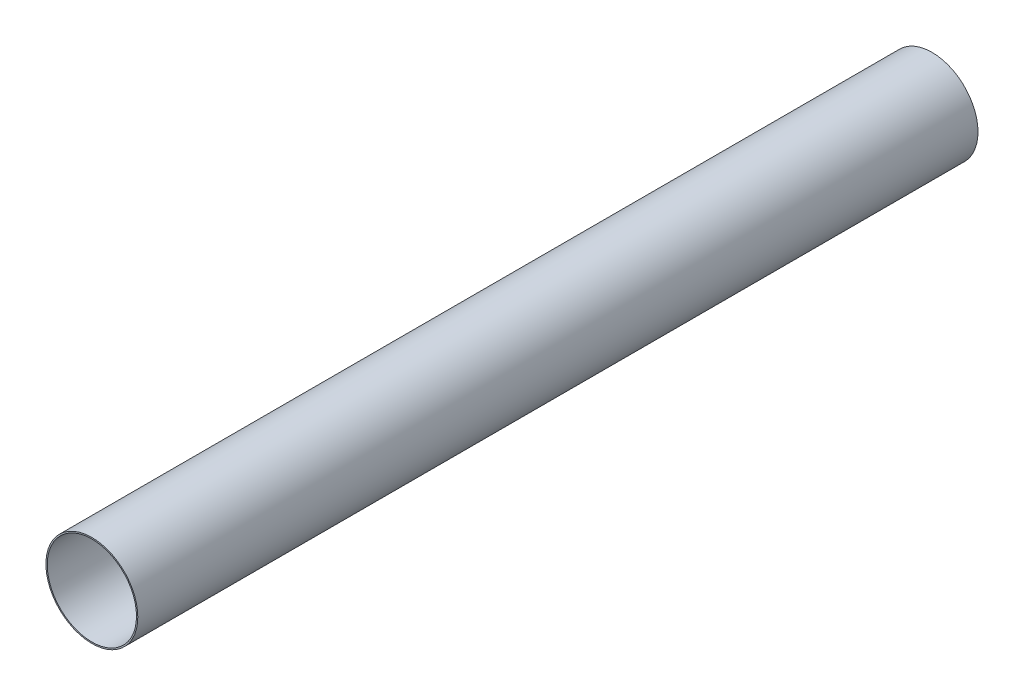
ISO-10303-21;
HEADER;
FILE_DESCRIPTION(('STEP AP214'),'2;1');
FILE_NAME('part.step','',(''),(''),'','','');
FILE_SCHEMA(('AUTOMOTIVE_DESIGN { 1 0 10303 214 1 1 1 1 }'));
ENDSEC;
DATA;
#1=APPLICATION_CONTEXT('core data for automotive mechanical design processes');
#2=APPLICATION_PROTOCOL_DEFINITION('international standard','automotive_design',2000,#1);
#3=PRODUCT_CONTEXT('',#1,'mechanical');
#4=PRODUCT('Part','Part','',(#3));
#5=PRODUCT_RELATED_PRODUCT_CATEGORY('part','',(#4));
#6=PRODUCT_DEFINITION_FORMATION('','',#4);
#7=PRODUCT_DEFINITION_CONTEXT('part definition',#1,'design');
#8=PRODUCT_DEFINITION('design','',#6,#7);
#9=PRODUCT_DEFINITION_SHAPE('','',#8);
#10=(LENGTH_UNIT() NAMED_UNIT(*) SI_UNIT(.MILLI.,.METRE.));
#11=(NAMED_UNIT(*) PLANE_ANGLE_UNIT() SI_UNIT($,.RADIAN.));
#12=(NAMED_UNIT(*) SI_UNIT($,.STERADIAN.) SOLID_ANGLE_UNIT());
#13=UNCERTAINTY_MEASURE_WITH_UNIT(LENGTH_MEASURE(1.E-05),#10,'distance_accuracy_value','');
#14=(GEOMETRIC_REPRESENTATION_CONTEXT(3) GLOBAL_UNCERTAINTY_ASSIGNED_CONTEXT((#13)) GLOBAL_UNIT_ASSIGNED_CONTEXT((#10,
#11,#12)) REPRESENTATION_CONTEXT('',''));
#15=CARTESIAN_POINT('',(0.,0.,0.));
#16=DIRECTION('',(0.,0.,1.));
#17=DIRECTION('',(1.,0.,0.));
#18=AXIS2_PLACEMENT_3D('',#15,#16,#17);
#19=CARTESIAN_POINT('',(0.,0.,508.));
#20=DIRECTION('',(0.,0.,1.));
#21=DIRECTION('',(1.,0.,0.));
#22=AXIS2_PLACEMENT_3D('',#19,#20,#21);
#23=PLANE('',#22);
#24=CARTESIAN_POINT('',(0.,0.,508.));
#25=DIRECTION('',(0.,0.,1.));
#26=DIRECTION('',(1.,0.,0.));
#27=AXIS2_PLACEMENT_3D('',#24,#25,#26);
#28=CIRCLE('',#27,27.78125);
#29=CARTESIAN_POINT('',(27.78125,0.,508.));
#30=VERTEX_POINT('',#29);
#31=EDGE_CURVE('E10',#30,#30,#28,.T.);
#32=ORIENTED_EDGE('',*,*,#31,.T.);
#33=EDGE_LOOP('',(#32));
#34=FACE_BOUND('',#33,.T.);
#35=CARTESIAN_POINT('',(0.,0.,508.));
#36=DIRECTION('',(0.,0.,1.));
#37=DIRECTION('',(1.,0.,0.));
#38=AXIS2_PLACEMENT_3D('',#35,#36,#37);
#39=CIRCLE('',#38,26.9875);
#40=CARTESIAN_POINT('',(26.9875,0.,508.));
#41=VERTEX_POINT('',#40);
#42=EDGE_CURVE('E40',#41,#41,#39,.T.);
#43=ORIENTED_EDGE('',*,*,#42,.F.);
#44=EDGE_LOOP('',(#43));
#45=FACE_BOUND('',#44,.T.);
#46=ADVANCED_FACE('F29',(#34,#45),#23,.T.);
#47=CARTESIAN_POINT('',(0.,0.,0.));
#48=DIRECTION('',(0.,0.,1.));
#49=DIRECTION('',(1.,0.,0.));
#50=AXIS2_PLACEMENT_3D('',#47,#48,#49);
#51=PLANE('',#50);
#52=CARTESIAN_POINT('',(0.,0.,0.));
#53=DIRECTION('',(0.,0.,1.));
#54=DIRECTION('',(1.,0.,0.));
#55=AXIS2_PLACEMENT_3D('',#52,#53,#54);
#56=CIRCLE('',#55,27.78125);
#57=CARTESIAN_POINT('',(27.78125,0.,0.));
#58=VERTEX_POINT('',#57);
#59=EDGE_CURVE('E36',#58,#58,#56,.T.);
#60=ORIENTED_EDGE('',*,*,#59,.F.);
#61=EDGE_LOOP('',(#60));
#62=FACE_BOUND('',#61,.T.);
#63=CARTESIAN_POINT('',(0.,0.,0.));
#64=DIRECTION('',(0.,0.,1.));
#65=DIRECTION('',(1.,0.,0.));
#66=AXIS2_PLACEMENT_3D('',#63,#64,#65);
#67=CIRCLE('',#66,26.9875);
#68=CARTESIAN_POINT('',(26.9875,0.,0.));
#69=VERTEX_POINT('',#68);
#70=EDGE_CURVE('E44',#69,#69,#67,.T.);
#71=ORIENTED_EDGE('',*,*,#70,.T.);
#72=EDGE_LOOP('',(#71));
#73=FACE_BOUND('',#72,.T.);
#74=ADVANCED_FACE('F50',(#62,#73),#51,.F.);
#75=CARTESIAN_POINT('',(0.,0.,508.));
#76=DIRECTION('',(0.,0.,-1.));
#77=DIRECTION('',(-1.,0.,0.));
#78=AXIS2_PLACEMENT_3D('',#75,#76,#77);
#79=CYLINDRICAL_SURFACE('',#78,27.78125);
#80=ORIENTED_EDGE('',*,*,#31,.F.);
#81=EDGE_LOOP('',(#80));
#82=FACE_BOUND('',#81,.T.);
#83=ORIENTED_EDGE('',*,*,#59,.T.);
#84=EDGE_LOOP('',(#83));
#85=FACE_BOUND('',#84,.T.);
#86=ADVANCED_FACE('F31',(#82,#85),#79,.T.);
#87=CARTESIAN_POINT('',(0.,0.,508.));
#88=DIRECTION('',(0.,0.,-1.));
#89=DIRECTION('',(-1.,0.,0.));
#90=AXIS2_PLACEMENT_3D('',#87,#88,#89);
#91=CYLINDRICAL_SURFACE('',#90,26.9875);
#92=ORIENTED_EDGE('',*,*,#42,.T.);
#93=EDGE_LOOP('',(#92));
#94=FACE_BOUND('',#93,.T.);
#95=ORIENTED_EDGE('',*,*,#70,.F.);
#96=EDGE_LOOP('',(#95));
#97=FACE_BOUND('',#96,.T.);
#98=ADVANCED_FACE('F52',(#94,#97),#91,.F.);
#99=CLOSED_SHELL('',(#46,#74,#86,#98));
#100=MANIFOLD_SOLID_BREP('B2',#99);
#101=ADVANCED_BREP_SHAPE_REPRESENTATION('',(#18,#100),#14);
#102=SHAPE_DEFINITION_REPRESENTATION(#9,#101);
ENDSEC;
END-ISO-10303-21;
